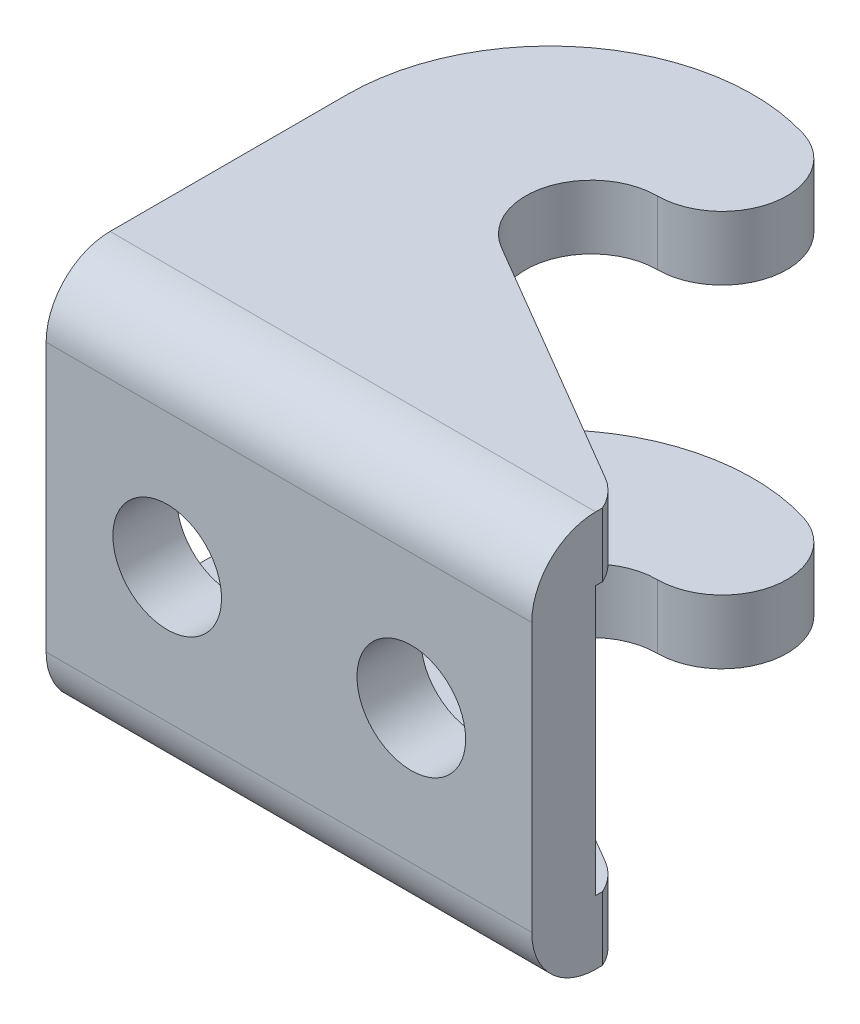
ISO-10303-21;
HEADER;
FILE_DESCRIPTION(('STEP AP214'),'2;1');
FILE_NAME('part.step','',(''),(''),'','','');
FILE_SCHEMA(('AUTOMOTIVE_DESIGN { 1 0 10303 214 1 1 1 1 }'));
ENDSEC;
DATA;
#1=APPLICATION_CONTEXT('core data for automotive mechanical design processes');
#2=APPLICATION_PROTOCOL_DEFINITION('international standard','automotive_design',2000,#1);
#3=PRODUCT_CONTEXT('',#1,'mechanical');
#4=PRODUCT('Part','Part','',(#3));
#5=PRODUCT_RELATED_PRODUCT_CATEGORY('part','',(#4));
#6=PRODUCT_DEFINITION_FORMATION('','',#4);
#7=PRODUCT_DEFINITION_CONTEXT('part definition',#1,'design');
#8=PRODUCT_DEFINITION('design','',#6,#7);
#9=PRODUCT_DEFINITION_SHAPE('','',#8);
#10=(LENGTH_UNIT() NAMED_UNIT(*) SI_UNIT(.MILLI.,.METRE.));
#11=(NAMED_UNIT(*) PLANE_ANGLE_UNIT() SI_UNIT($,.RADIAN.));
#12=(NAMED_UNIT(*) SI_UNIT($,.STERADIAN.) SOLID_ANGLE_UNIT());
#13=UNCERTAINTY_MEASURE_WITH_UNIT(LENGTH_MEASURE(1.E-05),#10,'distance_accuracy_value','');
#14=(GEOMETRIC_REPRESENTATION_CONTEXT(3) GLOBAL_UNCERTAINTY_ASSIGNED_CONTEXT((#13)) GLOBAL_UNIT_ASSIGNED_CONTEXT((#10,
#11,#12)) REPRESENTATION_CONTEXT('',''));
#15=CARTESIAN_POINT('',(0.,0.,0.));
#16=DIRECTION('',(0.,0.,1.));
#17=DIRECTION('',(1.,0.,0.));
#18=AXIS2_PLACEMENT_3D('',#15,#16,#17);
#19=CARTESIAN_POINT('',(10.0563664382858,-39.6717802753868,-5.0616060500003));
#20=DIRECTION('',(1.,0.,0.));
#21=DIRECTION('',(0.,0.,-1.));
#22=AXIS2_PLACEMENT_3D('',#19,#20,#21);
#23=CYLINDRICAL_SURFACE('',#22,0.001000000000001);
#24=CARTESIAN_POINT('',(29.5847143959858,-39.6717802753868,-5.0616060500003));
#25=DIRECTION('',(1.,0.,0.));
#26=DIRECTION('',(0.,0.,-1.));
#27=AXIS2_PLACEMENT_3D('',#24,#25,#26);
#28=CIRCLE('',#27,0.001000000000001);
#29=CARTESIAN_POINT('',(29.5847143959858,-39.6717802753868,-5.0606060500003));
#30=VERTEX_POINT('',#29);
#31=CARTESIAN_POINT('',(29.5847143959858,-39.6727802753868,-5.0616060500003));
#32=VERTEX_POINT('',#31);
#33=EDGE_CURVE('E161',#30,#32,#28,.T.);
#34=ORIENTED_EDGE('',*,*,#33,.F.);
#35=DIRECTION('',(1.,0.,0.));
#36=VECTOR('',#35,1.);
#37=CARTESIAN_POINT('',(45.4597143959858,-39.6717802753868,-5.0606060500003));
#38=LINE('',#37,#36);
#39=CARTESIAN_POINT('',(67.5847143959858,-39.6717802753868,-5.0606060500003));
#40=VERTEX_POINT('',#39);
#41=EDGE_CURVE('E163',#30,#40,#38,.T.);
#42=ORIENTED_EDGE('',*,*,#41,.T.);
#43=CARTESIAN_POINT('',(67.5847143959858,-39.6717802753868,-5.06160605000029));
#44=DIRECTION('',(-1.,0.,0.));
#45=DIRECTION('',(0.,0.,1.));
#46=AXIS2_PLACEMENT_3D('',#43,#44,#45);
#47=CIRCLE('',#46,0.001000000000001);
#48=CARTESIAN_POINT('',(67.5847143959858,-39.6727802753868,-5.06160605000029));
#49=VERTEX_POINT('',#48);
#50=EDGE_CURVE('E17',#49,#40,#47,.T.);
#51=ORIENTED_EDGE('',*,*,#50,.F.);
#52=DIRECTION('',(1.,0.,0.));
#53=VECTOR('',#52,1.);
#54=CARTESIAN_POINT('',(45.4597143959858,-39.6727802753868,-5.06160605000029));
#55=LINE('',#54,#53);
#56=EDGE_CURVE('E220',#49,#32,#55,.F.);
#57=ORIENTED_EDGE('',*,*,#56,.T.);
#58=EDGE_LOOP('',(#34,#42,#51,#57));
#59=FACE_BOUND('',#58,.T.);
#60=ADVANCED_FACE('F14',(#59),#23,.F.);
#61=CARTESIAN_POINT('',(48.5847143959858,-44.6727802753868,-23.7316365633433));
#62=DIRECTION('',(0.,1.,0.));
#63=DIRECTION('',(0.,0.,1.));
#64=AXIS2_PLACEMENT_3D('',#61,#62,#63);
#65=CYLINDRICAL_SURFACE('',#64,5.15);
#66=DIRECTION('',(0.,1.,0.));
#67=VECTOR('',#66,1.);
#68=CARTESIAN_POINT('',(48.5847143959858,-44.6727802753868,-28.8816365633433));
#69=LINE('',#68,#67);
#70=CARTESIAN_POINT('',(48.5847143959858,-39.6727802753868,-28.8816365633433));
#71=VERTEX_POINT('',#70);
#72=CARTESIAN_POINT('',(48.5847143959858,-44.6727802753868,-28.8816365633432));
#73=VERTEX_POINT('',#72);
#74=EDGE_CURVE('E232',#71,#73,#69,.F.);
#75=ORIENTED_EDGE('',*,*,#74,.F.);
#76=CARTESIAN_POINT('',(48.5847143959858,-39.6727802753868,-23.7316365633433));
#77=DIRECTION('',(0.,1.,0.));
#78=DIRECTION('',(0.,0.,1.));
#79=AXIS2_PLACEMENT_3D('',#76,#77,#78);
#80=CIRCLE('',#79,5.15);
#81=CARTESIAN_POINT('',(45.9778023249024,-39.6727802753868,-19.2901830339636));
#82=VERTEX_POINT('',#81);
#83=EDGE_CURVE('E219',#71,#82,#80,.T.);
#84=ORIENTED_EDGE('',*,*,#83,.T.);
#85=DIRECTION('',(0.,1.,0.));
#86=VECTOR('',#85,1.);
#87=CARTESIAN_POINT('',(45.9778023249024,-44.6727802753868,-19.2901830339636));
#88=LINE('',#87,#86);
#89=CARTESIAN_POINT('',(45.9778023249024,-44.6727802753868,-19.2901830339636));
#90=VERTEX_POINT('',#89);
#91=EDGE_CURVE('E233',#82,#90,#88,.F.);
#92=ORIENTED_EDGE('',*,*,#91,.T.);
#93=CARTESIAN_POINT('',(48.5847143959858,-44.6727802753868,-23.7316365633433));
#94=DIRECTION('',(0.,1.,0.));
#95=DIRECTION('',(0.,0.,1.));
#96=AXIS2_PLACEMENT_3D('',#93,#94,#95);
#97=CIRCLE('',#96,5.15);
#98=EDGE_CURVE('E199',#73,#90,#97,.T.);
#99=ORIENTED_EDGE('',*,*,#98,.F.);
#100=EDGE_LOOP('',(#75,#84,#92,#99));
#101=FACE_BOUND('',#100,.T.);
#102=ADVANCED_FACE('F381',(#101),#65,.F.);
#103=CARTESIAN_POINT('',(65.663136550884,-44.6727802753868,-7.73587202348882));
#104=DIRECTION('',(-0.506196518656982,0.,0.862418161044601));
#105=DIRECTION('',(0.862418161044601,0.,0.506196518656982));
#106=AXIS2_PLACEMENT_3D('',#103,#104,#105);
#107=PLANE('',#106);
#108=ORIENTED_EDGE('',*,*,#91,.F.);
#109=DIRECTION('',(0.862418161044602,0.,0.506196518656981));
#110=VECTOR('',#109,1.);
#111=CARTESIAN_POINT('',(45.9778023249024,-39.6727802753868,-19.2901830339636));
#112=LINE('',#111,#110);
#113=CARTESIAN_POINT('',(65.663136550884,-39.6727802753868,-7.73587202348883));
#114=VERTEX_POINT('',#113);
#115=EDGE_CURVE('E216',#82,#114,#112,.T.);
#116=ORIENTED_EDGE('',*,*,#115,.T.);
#117=DIRECTION('',(0.,1.,0.));
#118=VECTOR('',#117,1.);
#119=CARTESIAN_POINT('',(65.663136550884,-44.6727802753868,-7.73587202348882));
#120=LINE('',#119,#118);
#121=CARTESIAN_POINT('',(65.663136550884,-44.6727802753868,-7.73587202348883));
#122=VERTEX_POINT('',#121);
#123=EDGE_CURVE('E229',#122,#114,#120,.T.);
#124=ORIENTED_EDGE('',*,*,#123,.F.);
#125=DIRECTION('',(0.862418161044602,0.,0.506196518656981));
#126=VECTOR('',#125,1.);
#127=CARTESIAN_POINT('',(45.9778023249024,-44.6727802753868,-19.2901830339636));
#128=LINE('',#127,#126);
#129=EDGE_CURVE('E195',#90,#122,#128,.T.);
#130=ORIENTED_EDGE('',*,*,#129,.F.);
#131=EDGE_LOOP('',(#108,#116,#124,#130));
#132=FACE_BOUND('',#131,.T.);
#133=ADVANCED_FACE('F378',(#132),#107,.F.);
#134=CARTESIAN_POINT('',(48.5847143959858,-44.6727802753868,-33.957335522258));
#135=DIRECTION('',(0.,1.,0.));
#136=DIRECTION('',(0.,0.,1.));
#137=AXIS2_PLACEMENT_3D('',#134,#135,#136);
#138=CYLINDRICAL_SURFACE('',#137,5.07569895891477);
#139=CARTESIAN_POINT('',(48.5847143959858,-44.6727802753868,-33.957335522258));
#140=DIRECTION('',(0.,1.,0.));
#141=DIRECTION('',(0.,0.,1.));
#142=AXIS2_PLACEMENT_3D('',#139,#140,#141);
#143=CIRCLE('',#142,5.07569895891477);
#144=CARTESIAN_POINT('',(50.0534723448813,-44.6727802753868,-38.8158816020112));
#145=VERTEX_POINT('',#144);
#146=EDGE_CURVE('E280',#145,#73,#143,.F.);
#147=ORIENTED_EDGE('',*,*,#146,.F.);
#148=DIRECTION('',(0.,1.,0.));
#149=VECTOR('',#148,1.);
#150=CARTESIAN_POINT('',(50.0534723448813,-44.6727802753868,-38.8158816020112));
#151=LINE('',#150,#149);
#152=CARTESIAN_POINT('',(50.0534723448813,-39.6727802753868,-38.8158816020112));
#153=VERTEX_POINT('',#152);
#154=EDGE_CURVE('E226',#153,#145,#151,.F.);
#155=ORIENTED_EDGE('',*,*,#154,.F.);
#156=CARTESIAN_POINT('',(48.5847143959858,-39.6727802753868,-33.957335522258));
#157=DIRECTION('',(0.,1.,0.));
#158=DIRECTION('',(0.,0.,1.));
#159=AXIS2_PLACEMENT_3D('',#156,#157,#158);
#160=CIRCLE('',#159,5.07569895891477);
#161=EDGE_CURVE('E222',#153,#71,#160,.F.);
#162=ORIENTED_EDGE('',*,*,#161,.T.);
#163=ORIENTED_EDGE('',*,*,#74,.T.);
#164=EDGE_LOOP('',(#147,#155,#162,#163));
#165=FACE_BOUND('',#164,.T.);
#166=ADVANCED_FACE('F384',(#165),#138,.T.);
#167=CARTESIAN_POINT('',(39.0597143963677,-29.1727797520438,-5.0606060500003));
#168=DIRECTION('',(0.,0.,-1.));
#169=DIRECTION('',(-1.,0.,0.));
#170=AXIS2_PLACEMENT_3D('',#167,#168,#169);
#171=CYLINDRICAL_SURFACE('',#170,4.25);
#172=CARTESIAN_POINT('',(39.0597143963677,-29.1727797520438,-5.0606060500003));
#173=DIRECTION('',(0.,0.,-1.));
#174=DIRECTION('',(-1.,0.,0.));
#175=AXIS2_PLACEMENT_3D('',#172,#173,#174);
#176=CIRCLE('',#175,4.25);
#177=CARTESIAN_POINT('',(34.8097143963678,-29.1727797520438,-5.0606060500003));
#178=VERTEX_POINT('',#177);
#179=EDGE_CURVE('E168',#178,#178,#176,.T.);
#180=ORIENTED_EDGE('',*,*,#179,.T.);
#181=EDGE_LOOP('',(#180));
#182=FACE_BOUND('',#181,.T.);
#183=CARTESIAN_POINT('',(39.0597143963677,-29.1727797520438,-0.0606060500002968));
#184=DIRECTION('',(0.,0.,-1.));
#185=DIRECTION('',(-1.,0.,0.));
#186=AXIS2_PLACEMENT_3D('',#183,#184,#185);
#187=CIRCLE('',#186,4.25);
#188=CARTESIAN_POINT('',(34.8097143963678,-29.1727797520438,-0.0606060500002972));
#189=VERTEX_POINT('',#188);
#190=EDGE_CURVE('E211',#189,#189,#187,.T.);
#191=ORIENTED_EDGE('',*,*,#190,.F.);
#192=EDGE_LOOP('',(#191));
#193=FACE_BOUND('',#192,.T.);
#194=ADVANCED_FACE('F541',(#182,#193),#171,.F.);
#195=CARTESIAN_POINT('',(58.1597143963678,-29.1727797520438,-0.0606060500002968));
#196=DIRECTION('',(0.,0.,1.));
#197=DIRECTION('',(1.,0.,0.));
#198=AXIS2_PLACEMENT_3D('',#195,#196,#197);
#199=CYLINDRICAL_SURFACE('',#198,4.25);
#200=CARTESIAN_POINT('',(58.1597143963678,-29.1727797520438,-5.0606060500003));
#201=DIRECTION('',(0.,0.,1.));
#202=DIRECTION('',(1.,0.,0.));
#203=AXIS2_PLACEMENT_3D('',#200,#201,#202);
#204=CIRCLE('',#203,4.25);
#205=CARTESIAN_POINT('',(62.4097143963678,-29.1727797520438,-5.0606060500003));
#206=VERTEX_POINT('',#205);
#207=EDGE_CURVE('E286',#206,#206,#204,.F.);
#208=ORIENTED_EDGE('',*,*,#207,.T.);
#209=EDGE_LOOP('',(#208));
#210=FACE_BOUND('',#209,.T.);
#211=CARTESIAN_POINT('',(58.1597143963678,-29.1727797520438,-0.0606060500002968));
#212=DIRECTION('',(0.,0.,1.));
#213=DIRECTION('',(1.,0.,0.));
#214=AXIS2_PLACEMENT_3D('',#211,#212,#213);
#215=CIRCLE('',#214,4.25);
#216=CARTESIAN_POINT('',(62.4097143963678,-29.1727797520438,-0.0606060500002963));
#217=VERTEX_POINT('',#216);
#218=EDGE_CURVE('E189',#217,#217,#215,.F.);
#219=ORIENTED_EDGE('',*,*,#218,.F.);
#220=EDGE_LOOP('',(#219));
#221=FACE_BOUND('',#220,.T.);
#222=ADVANCED_FACE('F532',(#210,#221),#199,.F.);
#223=CARTESIAN_POINT('',(63.252375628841,-44.6727802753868,-3.62860552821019));
#224=DIRECTION('',(0.,1.,0.));
#225=DIRECTION('',(0.,0.,1.));
#226=AXIS2_PLACEMENT_3D('',#223,#224,#225);
#227=CYLINDRICAL_SURFACE('',#226,4.76250000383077);
#228=CARTESIAN_POINT('',(63.252375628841,-44.6727802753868,-3.62860552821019));
#229=DIRECTION('',(0.,1.,0.));
#230=DIRECTION('',(0.,0.,1.));
#231=AXIS2_PLACEMENT_3D('',#228,#229,#230);
#232=CIRCLE('',#231,4.76250000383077);
#233=CARTESIAN_POINT('',(67.5847143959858,-44.6727802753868,-5.60654564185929));
#234=VERTEX_POINT('',#233);
#235=EDGE_CURVE('E198',#122,#234,#232,.F.);
#236=ORIENTED_EDGE('',*,*,#235,.F.);
#237=ORIENTED_EDGE('',*,*,#123,.T.);
#238=CARTESIAN_POINT('',(63.252375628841,-39.6727802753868,-3.62860552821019));
#239=DIRECTION('',(0.,1.,0.));
#240=DIRECTION('',(0.,0.,1.));
#241=AXIS2_PLACEMENT_3D('',#238,#239,#240);
#242=CIRCLE('',#241,4.76250000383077);
#243=CARTESIAN_POINT('',(67.5847143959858,-39.6727802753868,-5.60654564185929));
#244=VERTEX_POINT('',#243);
#245=EDGE_CURVE('E218',#114,#244,#242,.F.);
#246=ORIENTED_EDGE('',*,*,#245,.T.);
#247=DIRECTION('',(0.,1.,0.));
#248=VECTOR('',#247,1.);
#249=CARTESIAN_POINT('',(67.5847143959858,-44.6727802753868,-5.60654564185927));
#250=LINE('',#249,#248);
#251=EDGE_CURVE('E176',#244,#234,#250,.F.);
#252=ORIENTED_EDGE('',*,*,#251,.T.);
#253=EDGE_LOOP('',(#236,#237,#246,#252));
#254=FACE_BOUND('',#253,.T.);
#255=ADVANCED_FACE('F373',(#254),#227,.T.);
#256=CARTESIAN_POINT('',(87.1130623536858,-18.6737792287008,-5.06160605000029));
#257=DIRECTION('',(-1.,0.,0.));
#258=DIRECTION('',(0.,0.,1.));
#259=AXIS2_PLACEMENT_3D('',#256,#257,#258);
#260=CYLINDRICAL_SURFACE('',#259,0.000999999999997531);
#261=CARTESIAN_POINT('',(29.5847143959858,-18.6737792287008,-5.0616060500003));
#262=DIRECTION('',(1.,0.,0.));
#263=DIRECTION('',(0.,0.,-1.));
#264=AXIS2_PLACEMENT_3D('',#261,#262,#263);
#265=CIRCLE('',#264,0.000999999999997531);
#266=CARTESIAN_POINT('',(29.5847143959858,-18.6727792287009,-5.0616060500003));
#267=VERTEX_POINT('',#266);
#268=CARTESIAN_POINT('',(29.5847143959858,-18.6737792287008,-5.0606060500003));
#269=VERTEX_POINT('',#268);
#270=EDGE_CURVE('E223',#267,#269,#265,.T.);
#271=ORIENTED_EDGE('',*,*,#270,.F.);
#272=DIRECTION('',(-1.,0.,0.));
#273=VECTOR('',#272,1.);
#274=CARTESIAN_POINT('',(45.4597143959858,-18.6727792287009,-5.0616060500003));
#275=LINE('',#274,#273);
#276=CARTESIAN_POINT('',(67.5847143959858,-18.6727792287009,-5.0616060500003));
#277=VERTEX_POINT('',#276);
#278=EDGE_CURVE('E213',#267,#277,#275,.F.);
#279=ORIENTED_EDGE('',*,*,#278,.T.);
#280=CARTESIAN_POINT('',(67.5847143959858,-18.6737792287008,-5.06160605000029));
#281=DIRECTION('',(-1.,0.,0.));
#282=DIRECTION('',(0.,0.,1.));
#283=AXIS2_PLACEMENT_3D('',#280,#281,#282);
#284=CIRCLE('',#283,0.000999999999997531);
#285=CARTESIAN_POINT('',(67.5847143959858,-18.6737792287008,-5.0606060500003));
#286=VERTEX_POINT('',#285);
#287=EDGE_CURVE('E174',#277,#286,#284,.F.);
#288=ORIENTED_EDGE('',*,*,#287,.T.);
#289=DIRECTION('',(1.,0.,0.));
#290=VECTOR('',#289,1.);
#291=CARTESIAN_POINT('',(45.4597143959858,-18.6737792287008,-5.0606060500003));
#292=LINE('',#291,#290);
#293=EDGE_CURVE('E167',#286,#269,#292,.F.);
#294=ORIENTED_EDGE('',*,*,#293,.T.);
#295=EDGE_LOOP('',(#271,#279,#288,#294));
#296=FACE_BOUND('',#295,.T.);
#297=ADVANCED_FACE('F514',(#296),#260,.F.);
#298=CARTESIAN_POINT('',(45.4597143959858,-39.6727802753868,42.3519715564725));
#299=DIRECTION('',(0.,-1.,0.));
#300=DIRECTION('',(0.,0.,-1.));
#301=AXIS2_PLACEMENT_3D('',#298,#299,#300);
#302=PLANE('',#301);
#303=ORIENTED_EDGE('',*,*,#115,.F.);
#304=ORIENTED_EDGE('',*,*,#83,.F.);
#305=ORIENTED_EDGE('',*,*,#161,.F.);
#306=CARTESIAN_POINT('',(45.4597143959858,-39.6727802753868,-23.6200593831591));
#307=DIRECTION('',(0.,1.,0.));
#308=DIRECTION('',(0.,0.,1.));
#309=AXIS2_PLACEMENT_3D('',#306,#307,#308);
#310=CIRCLE('',#309,15.875);
#311=CARTESIAN_POINT('',(29.5847143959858,-39.6727802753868,-23.6200593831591));
#312=VERTEX_POINT('',#311);
#313=EDGE_CURVE('E203',#312,#153,#310,.F.);
#314=ORIENTED_EDGE('',*,*,#313,.F.);
#315=DIRECTION('',(0.,0.,-1.));
#316=VECTOR('',#315,1.);
#317=CARTESIAN_POINT('',(29.5847143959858,-39.6727802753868,42.3519715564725));
#318=LINE('',#317,#316);
#319=EDGE_CURVE('E299',#312,#32,#318,.F.);
#320=ORIENTED_EDGE('',*,*,#319,.T.);
#321=ORIENTED_EDGE('',*,*,#56,.F.);
#322=DIRECTION('',(0.,0.,1.));
#323=VECTOR('',#322,1.);
#324=CARTESIAN_POINT('',(67.5847143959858,-39.6727802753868,-5.60654564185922));
#325=LINE('',#324,#323);
#326=EDGE_CURVE('E160',#49,#244,#325,.F.);
#327=ORIENTED_EDGE('',*,*,#326,.T.);
#328=ORIENTED_EDGE('',*,*,#245,.F.);
#329=EDGE_LOOP('',(#303,#304,#305,#314,#320,#321,#327,#328));
#330=FACE_BOUND('',#329,.T.);
#331=ADVANCED_FACE('F303',(#330),#302,.F.);
#332=CARTESIAN_POINT('',(45.4597143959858,3.81323571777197,-5.0606060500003));
#333=DIRECTION('',(0.,0.,1.));
#334=DIRECTION('',(1.,0.,0.));
#335=AXIS2_PLACEMENT_3D('',#332,#333,#334);
#336=PLANE('',#335);
#337=ORIENTED_EDGE('',*,*,#293,.F.);
#338=DIRECTION('',(0.,1.,0.));
#339=VECTOR('',#338,1.);
#340=CARTESIAN_POINT('',(67.5847143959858,-44.6727802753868,-5.0606060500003));
#341=LINE('',#340,#339);
#342=EDGE_CURVE('E157',#286,#40,#341,.F.);
#343=ORIENTED_EDGE('',*,*,#342,.T.);
#344=ORIENTED_EDGE('',*,*,#41,.F.);
#345=DIRECTION('',(0.,1.,0.));
#346=VECTOR('',#345,1.);
#347=CARTESIAN_POINT('',(29.5847143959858,-44.6727802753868,-5.0606060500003));
#348=LINE('',#347,#346);
#349=EDGE_CURVE('E300',#30,#269,#348,.T.);
#350=ORIENTED_EDGE('',*,*,#349,.T.);
#351=EDGE_LOOP('',(#337,#343,#344,#350));
#352=FACE_BOUND('',#351,.T.);
#353=ORIENTED_EDGE('',*,*,#179,.F.);
#354=EDGE_LOOP('',(#353));
#355=FACE_BOUND('',#354,.T.);
#356=ORIENTED_EDGE('',*,*,#207,.F.);
#357=EDGE_LOOP('',(#356));
#358=FACE_BOUND('',#357,.T.);
#359=ADVANCED_FACE('F171',(#352,#355,#358),#336,.F.);
#360=CARTESIAN_POINT('',(10.0563664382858,-39.6717802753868,-5.0616060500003));
#361=DIRECTION('',(1.,0.,0.));
#362=DIRECTION('',(0.,0.,-1.));
#363=AXIS2_PLACEMENT_3D('',#360,#361,#362);
#364=CYLINDRICAL_SURFACE('',#363,5.001);
#365=DIRECTION('',(1.,0.,0.));
#366=VECTOR('',#365,1.);
#367=CARTESIAN_POINT('',(45.4597143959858,-44.6727802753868,-5.06160605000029));
#368=LINE('',#367,#366);
#369=CARTESIAN_POINT('',(67.5847143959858,-44.6727802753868,-5.06160605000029));
#370=VERTEX_POINT('',#369);
#371=CARTESIAN_POINT('',(29.5847143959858,-44.6727802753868,-5.0616060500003));
#372=VERTEX_POINT('',#371);
#373=EDGE_CURVE('E200',#370,#372,#368,.F.);
#374=ORIENTED_EDGE('',*,*,#373,.F.);
#375=CARTESIAN_POINT('',(67.5847143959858,-39.6717802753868,-5.06160605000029));
#376=DIRECTION('',(1.,0.,0.));
#377=DIRECTION('',(0.,0.,-1.));
#378=AXIS2_PLACEMENT_3D('',#375,#376,#377);
#379=CIRCLE('',#378,5.001);
#380=CARTESIAN_POINT('',(67.5847143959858,-39.6717802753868,-0.0606060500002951));
#381=VERTEX_POINT('',#380);
#382=EDGE_CURVE('E185',#370,#381,#379,.F.);
#383=ORIENTED_EDGE('',*,*,#382,.T.);
#384=DIRECTION('',(1.,0.,0.));
#385=VECTOR('',#384,1.);
#386=CARTESIAN_POINT('',(45.4597143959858,-39.6717802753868,-0.0606060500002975));
#387=LINE('',#386,#385);
#388=CARTESIAN_POINT('',(29.5847143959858,-39.6717802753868,-0.0606060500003));
#389=VERTEX_POINT('',#388);
#390=EDGE_CURVE('E208',#389,#381,#387,.T.);
#391=ORIENTED_EDGE('',*,*,#390,.F.);
#392=CARTESIAN_POINT('',(29.5847143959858,-39.6717802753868,-5.0616060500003));
#393=DIRECTION('',(1.,0.,0.));
#394=DIRECTION('',(0.,0.,-1.));
#395=AXIS2_PLACEMENT_3D('',#392,#393,#394);
#396=CIRCLE('',#395,5.001);
#397=EDGE_CURVE('E255',#389,#372,#396,.T.);
#398=ORIENTED_EDGE('',*,*,#397,.T.);
#399=EDGE_LOOP('',(#374,#383,#391,#398));
#400=FACE_BOUND('',#399,.T.);
#401=ADVANCED_FACE('F367',(#400),#364,.T.);
#402=CARTESIAN_POINT('',(45.4597143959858,-44.6727802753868,42.3519715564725));
#403=DIRECTION('',(0.,-1.,0.));
#404=DIRECTION('',(0.,0.,-1.));
#405=AXIS2_PLACEMENT_3D('',#402,#403,#404);
#406=PLANE('',#405);
#407=DIRECTION('',(0.,0.,-1.));
#408=VECTOR('',#407,1.);
#409=CARTESIAN_POINT('',(29.5847143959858,-44.6727802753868,42.3519715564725));
#410=LINE('',#409,#408);
#411=CARTESIAN_POINT('',(29.5847143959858,-44.6727802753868,-23.6200593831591));
#412=VERTEX_POINT('',#411);
#413=EDGE_CURVE('E207',#372,#412,#410,.T.);
#414=ORIENTED_EDGE('',*,*,#413,.T.);
#415=CARTESIAN_POINT('',(45.4597143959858,-44.6727802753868,-23.6200593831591));
#416=DIRECTION('',(0.,1.,0.));
#417=DIRECTION('',(0.,0.,1.));
#418=AXIS2_PLACEMENT_3D('',#415,#416,#417);
#419=CIRCLE('',#418,15.875);
#420=EDGE_CURVE('E212',#145,#412,#419,.T.);
#421=ORIENTED_EDGE('',*,*,#420,.F.);
#422=ORIENTED_EDGE('',*,*,#146,.T.);
#423=ORIENTED_EDGE('',*,*,#98,.T.);
#424=ORIENTED_EDGE('',*,*,#129,.T.);
#425=ORIENTED_EDGE('',*,*,#235,.T.);
#426=DIRECTION('',(0.,0.,1.));
#427=VECTOR('',#426,1.);
#428=CARTESIAN_POINT('',(67.5847143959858,-44.6727802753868,-5.60654564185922));
#429=LINE('',#428,#427);
#430=EDGE_CURVE('E186',#234,#370,#429,.T.);
#431=ORIENTED_EDGE('',*,*,#430,.T.);
#432=ORIENTED_EDGE('',*,*,#373,.T.);
#433=EDGE_LOOP('',(#414,#421,#422,#423,#424,#425,#431,#432));
#434=FACE_BOUND('',#433,.T.);
#435=ADVANCED_FACE('F369',(#434),#406,.T.);
#436=CARTESIAN_POINT('',(45.4597143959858,-44.6727802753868,-23.6200593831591));
#437=DIRECTION('',(0.,1.,0.));
#438=DIRECTION('',(0.,0.,1.));
#439=AXIS2_PLACEMENT_3D('',#436,#437,#438);
#440=CYLINDRICAL_SURFACE('',#439,15.875);
#441=ORIENTED_EDGE('',*,*,#420,.T.);
#442=DIRECTION('',(0.,1.,0.));
#443=VECTOR('',#442,1.);
#444=CARTESIAN_POINT('',(29.5847143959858,-44.6727802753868,-23.6200593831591));
#445=LINE('',#444,#443);
#446=EDGE_CURVE('E204',#412,#312,#445,.T.);
#447=ORIENTED_EDGE('',*,*,#446,.T.);
#448=ORIENTED_EDGE('',*,*,#313,.T.);
#449=ORIENTED_EDGE('',*,*,#154,.T.);
#450=EDGE_LOOP('',(#441,#447,#448,#449));
#451=FACE_BOUND('',#450,.T.);
#452=ADVANCED_FACE('F387',(#451),#440,.T.);
#453=CARTESIAN_POINT('',(45.4597143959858,3.81323571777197,-0.0606060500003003));
#454=DIRECTION('',(0.,0.,1.));
#455=DIRECTION('',(1.,0.,0.));
#456=AXIS2_PLACEMENT_3D('',#453,#454,#455);
#457=PLANE('',#456);
#458=ORIENTED_EDGE('',*,*,#218,.T.);
#459=EDGE_LOOP('',(#458));
#460=FACE_BOUND('',#459,.T.);
#461=ORIENTED_EDGE('',*,*,#190,.T.);
#462=EDGE_LOOP('',(#461));
#463=FACE_BOUND('',#462,.T.);
#464=DIRECTION('',(-1.,0.,0.));
#465=VECTOR('',#464,1.);
#466=CARTESIAN_POINT('',(87.1130623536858,-18.6737792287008,-0.0606060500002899));
#467=LINE('',#466,#465);
#468=CARTESIAN_POINT('',(29.5847143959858,-18.6737792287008,-0.0606060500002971));
#469=VERTEX_POINT('',#468);
#470=CARTESIAN_POINT('',(67.5847143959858,-18.6737792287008,-0.0606060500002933));
#471=VERTEX_POINT('',#470);
#472=EDGE_CURVE('E190',#469,#471,#467,.F.);
#473=ORIENTED_EDGE('',*,*,#472,.F.);
#474=DIRECTION('',(0.,1.,0.));
#475=VECTOR('',#474,1.);
#476=CARTESIAN_POINT('',(29.5847143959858,-44.6727802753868,-0.0606060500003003));
#477=LINE('',#476,#475);
#478=EDGE_CURVE('E257',#469,#389,#477,.F.);
#479=ORIENTED_EDGE('',*,*,#478,.T.);
#480=ORIENTED_EDGE('',*,*,#390,.T.);
#481=DIRECTION('',(0.,1.,0.));
#482=VECTOR('',#481,1.);
#483=CARTESIAN_POINT('',(67.5847143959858,-44.6727802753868,-0.0606060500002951));
#484=LINE('',#483,#482);
#485=EDGE_CURVE('E183',#381,#471,#484,.T.);
#486=ORIENTED_EDGE('',*,*,#485,.T.);
#487=EDGE_LOOP('',(#473,#479,#480,#486));
#488=FACE_BOUND('',#487,.T.);
#489=ADVANCED_FACE('F362',(#460,#463,#488),#457,.T.);
#490=CARTESIAN_POINT('',(67.5847143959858,-44.6727802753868,-5.60654564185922));
#491=DIRECTION('',(-1.,0.,0.));
#492=DIRECTION('',(0.,0.,1.));
#493=AXIS2_PLACEMENT_3D('',#490,#491,#492);
#494=PLANE('',#493);
#495=ORIENTED_EDGE('',*,*,#326,.F.);
#496=ORIENTED_EDGE('',*,*,#50,.T.);
#497=ORIENTED_EDGE('',*,*,#342,.F.);
#498=ORIENTED_EDGE('',*,*,#287,.F.);
#499=DIRECTION('',(0.,0.,1.));
#500=VECTOR('',#499,1.);
#501=CARTESIAN_POINT('',(67.5847143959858,-18.6727792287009,-23.6200593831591));
#502=LINE('',#501,#500);
#503=CARTESIAN_POINT('',(67.5847143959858,-18.6727792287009,-5.6065456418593));
#504=VERTEX_POINT('',#503);
#505=EDGE_CURVE('E214',#277,#504,#502,.F.);
#506=ORIENTED_EDGE('',*,*,#505,.T.);
#507=DIRECTION('',(0.,-1.,0.));
#508=VECTOR('',#507,1.);
#509=CARTESIAN_POINT('',(67.5847143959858,-13.6727792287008,-5.60654564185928));
#510=LINE('',#509,#508);
#511=CARTESIAN_POINT('',(67.5847143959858,-13.6727792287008,-5.6065456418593));
#512=VERTEX_POINT('',#511);
#513=EDGE_CURVE('E250',#512,#504,#510,.T.);
#514=ORIENTED_EDGE('',*,*,#513,.F.);
#515=DIRECTION('',(0.,0.,1.));
#516=VECTOR('',#515,1.);
#517=CARTESIAN_POINT('',(67.5847143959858,-13.6727792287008,-5.60654564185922));
#518=LINE('',#517,#516);
#519=CARTESIAN_POINT('',(67.5847143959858,-13.6727792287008,-5.06160605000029));
#520=VERTEX_POINT('',#519);
#521=EDGE_CURVE('E178',#520,#512,#518,.F.);
#522=ORIENTED_EDGE('',*,*,#521,.F.);
#523=CARTESIAN_POINT('',(67.5847143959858,-18.6737792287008,-5.06160605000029));
#524=DIRECTION('',(-1.,0.,0.));
#525=DIRECTION('',(0.,0.,1.));
#526=AXIS2_PLACEMENT_3D('',#523,#524,#525);
#527=CIRCLE('',#526,5.001);
#528=EDGE_CURVE('E193',#471,#520,#527,.T.);
#529=ORIENTED_EDGE('',*,*,#528,.F.);
#530=ORIENTED_EDGE('',*,*,#485,.F.);
#531=ORIENTED_EDGE('',*,*,#382,.F.);
#532=ORIENTED_EDGE('',*,*,#430,.F.);
#533=ORIENTED_EDGE('',*,*,#251,.F.);
#534=EDGE_LOOP('',(#495,#496,#497,#498,#506,#514,#522,#529,#530,#531,#532,#533));
#535=FACE_BOUND('',#534,.T.);
#536=ADVANCED_FACE('F154',(#535),#494,.F.);
#537=CARTESIAN_POINT('',(45.4597143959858,-18.6727792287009,-23.6200593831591));
#538=DIRECTION('',(0.,1.,0.));
#539=DIRECTION('',(-1.,0.,0.));
#540=AXIS2_PLACEMENT_3D('',#537,#538,#539);
#541=PLANE('',#540);
#542=CARTESIAN_POINT('',(45.4597143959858,-18.6727792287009,-23.6200593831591));
#543=DIRECTION('',(0.,-1.,0.));
#544=DIRECTION('',(1.,0.,0.));
#545=AXIS2_PLACEMENT_3D('',#542,#543,#544);
#546=CIRCLE('',#545,15.875);
#547=CARTESIAN_POINT('',(50.0534723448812,-18.6727792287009,-38.8158816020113));
#548=VERTEX_POINT('',#547);
#549=CARTESIAN_POINT('',(29.5847143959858,-18.6727792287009,-23.6200593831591));
#550=VERTEX_POINT('',#549);
#551=EDGE_CURVE('E258',#548,#550,#546,.F.);
#552=ORIENTED_EDGE('',*,*,#551,.F.);
#553=CARTESIAN_POINT('',(48.5847143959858,-18.6727792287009,-33.957335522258));
#554=DIRECTION('',(0.,-1.,0.));
#555=DIRECTION('',(1.,0.,0.));
#556=AXIS2_PLACEMENT_3D('',#553,#554,#555);
#557=CIRCLE('',#556,5.07569895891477);
#558=CARTESIAN_POINT('',(48.5847143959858,-18.6727792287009,-28.8816365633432));
#559=VERTEX_POINT('',#558);
#560=EDGE_CURVE('E262',#559,#548,#557,.F.);
#561=ORIENTED_EDGE('',*,*,#560,.F.);
#562=CARTESIAN_POINT('',(48.5847143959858,-18.6727792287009,-23.7316365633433));
#563=DIRECTION('',(0.,-1.,0.));
#564=DIRECTION('',(1.,0.,0.));
#565=AXIS2_PLACEMENT_3D('',#562,#563,#564);
#566=CIRCLE('',#565,5.15);
#567=CARTESIAN_POINT('',(45.9778023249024,-18.6727792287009,-19.2901830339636));
#568=VERTEX_POINT('',#567);
#569=EDGE_CURVE('E266',#559,#568,#566,.F.);
#570=ORIENTED_EDGE('',*,*,#569,.T.);
#571=DIRECTION('',(0.862418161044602,0.,0.506196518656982));
#572=VECTOR('',#571,1.);
#573=CARTESIAN_POINT('',(65.663136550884,-18.6727792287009,-7.73587202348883));
#574=LINE('',#573,#572);
#575=CARTESIAN_POINT('',(65.663136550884,-18.6727792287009,-7.73587202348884));
#576=VERTEX_POINT('',#575);
#577=EDGE_CURVE('E317',#568,#576,#574,.T.);
#578=ORIENTED_EDGE('',*,*,#577,.T.);
#579=CARTESIAN_POINT('',(63.252375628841,-18.6727792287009,-3.6286055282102));
#580=DIRECTION('',(0.,-1.,0.));
#581=DIRECTION('',(1.,0.,0.));
#582=AXIS2_PLACEMENT_3D('',#579,#580,#581);
#583=CIRCLE('',#582,4.76250000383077);
#584=EDGE_CURVE('E248',#504,#576,#583,.F.);
#585=ORIENTED_EDGE('',*,*,#584,.F.);
#586=ORIENTED_EDGE('',*,*,#505,.F.);
#587=ORIENTED_EDGE('',*,*,#278,.F.);
#588=DIRECTION('',(0.,0.,-1.));
#589=VECTOR('',#588,1.);
#590=CARTESIAN_POINT('',(29.5847143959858,-18.6727792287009,42.3519715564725));
#591=LINE('',#590,#589);
#592=EDGE_CURVE('E305',#267,#550,#591,.T.);
#593=ORIENTED_EDGE('',*,*,#592,.T.);
#594=EDGE_LOOP('',(#552,#561,#570,#578,#585,#586,#587,#593));
#595=FACE_BOUND('',#594,.T.);
#596=ADVANCED_FACE('F325',(#595),#541,.F.);
#597=CARTESIAN_POINT('',(48.5847143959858,-13.6727792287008,-23.7316365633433));
#598=DIRECTION('',(0.,-1.,0.));
#599=DIRECTION('',(1.,0.,0.));
#600=AXIS2_PLACEMENT_3D('',#597,#598,#599);
#601=CYLINDRICAL_SURFACE('',#600,5.15);
#602=DIRECTION('',(0.,1.,0.));
#603=VECTOR('',#602,1.);
#604=CARTESIAN_POINT('',(45.9778023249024,-13.6727792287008,-19.2901830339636));
#605=LINE('',#604,#603);
#606=CARTESIAN_POINT('',(45.9778023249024,-13.6727792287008,-19.2901830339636));
#607=VERTEX_POINT('',#606);
#608=EDGE_CURVE('E318',#607,#568,#605,.F.);
#609=ORIENTED_EDGE('',*,*,#608,.T.);
#610=ORIENTED_EDGE('',*,*,#569,.F.);
#611=DIRECTION('',(0.,-1.,0.));
#612=VECTOR('',#611,1.);
#613=CARTESIAN_POINT('',(48.5847143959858,-13.6727792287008,-28.8816365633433));
#614=LINE('',#613,#612);
#615=CARTESIAN_POINT('',(48.5847143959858,-13.6727792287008,-28.8816365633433));
#616=VERTEX_POINT('',#615);
#617=EDGE_CURVE('E265',#616,#559,#614,.T.);
#618=ORIENTED_EDGE('',*,*,#617,.F.);
#619=CARTESIAN_POINT('',(48.5847143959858,-13.6727792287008,-23.7316365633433));
#620=DIRECTION('',(0.,-1.,0.));
#621=DIRECTION('',(1.,0.,0.));
#622=AXIS2_PLACEMENT_3D('',#619,#620,#621);
#623=CIRCLE('',#622,5.15);
#624=EDGE_CURVE('E245',#607,#616,#623,.T.);
#625=ORIENTED_EDGE('',*,*,#624,.F.);
#626=EDGE_LOOP('',(#609,#610,#618,#625));
#627=FACE_BOUND('',#626,.T.);
#628=ADVANCED_FACE('F352',(#627),#601,.F.);
#629=CARTESIAN_POINT('',(48.5847143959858,-13.6727792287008,-33.957335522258));
#630=DIRECTION('',(0.,-1.,0.));
#631=DIRECTION('',(1.,0.,0.));
#632=AXIS2_PLACEMENT_3D('',#629,#630,#631);
#633=CYLINDRICAL_SURFACE('',#632,5.07569895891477);
#634=ORIENTED_EDGE('',*,*,#560,.T.);
#635=DIRECTION('',(0.,-1.,0.));
#636=VECTOR('',#635,1.);
#637=CARTESIAN_POINT('',(50.0534723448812,-13.6727792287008,-38.8158816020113));
#638=LINE('',#637,#636);
#639=CARTESIAN_POINT('',(50.0534723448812,-13.6727792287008,-38.8158816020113));
#640=VERTEX_POINT('',#639);
#641=EDGE_CURVE('E261',#640,#548,#638,.T.);
#642=ORIENTED_EDGE('',*,*,#641,.F.);
#643=CARTESIAN_POINT('',(48.5847143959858,-13.6727792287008,-33.957335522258));
#644=DIRECTION('',(0.,-1.,0.));
#645=DIRECTION('',(1.,0.,0.));
#646=AXIS2_PLACEMENT_3D('',#643,#644,#645);
#647=CIRCLE('',#646,5.07569895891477);
#648=EDGE_CURVE('E243',#616,#640,#647,.F.);
#649=ORIENTED_EDGE('',*,*,#648,.F.);
#650=ORIENTED_EDGE('',*,*,#617,.T.);
#651=EDGE_LOOP('',(#634,#642,#649,#650));
#652=FACE_BOUND('',#651,.T.);
#653=ADVANCED_FACE('F349',(#652),#633,.T.);
#654=CARTESIAN_POINT('',(45.4597143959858,-13.6727792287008,-23.6200593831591));
#655=DIRECTION('',(0.,-1.,0.));
#656=DIRECTION('',(1.,0.,0.));
#657=AXIS2_PLACEMENT_3D('',#654,#655,#656);
#658=CYLINDRICAL_SURFACE('',#657,15.875);
#659=CARTESIAN_POINT('',(45.4597143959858,-13.6727792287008,-23.6200593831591));
#660=DIRECTION('',(0.,-1.,0.));
#661=DIRECTION('',(1.,0.,0.));
#662=AXIS2_PLACEMENT_3D('',#659,#660,#661);
#663=CIRCLE('',#662,15.875);
#664=CARTESIAN_POINT('',(29.5847143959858,-13.6727792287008,-23.6200593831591));
#665=VERTEX_POINT('',#664);
#666=EDGE_CURVE('E239',#640,#665,#663,.F.);
#667=ORIENTED_EDGE('',*,*,#666,.F.);
#668=ORIENTED_EDGE('',*,*,#641,.T.);
#669=ORIENTED_EDGE('',*,*,#551,.T.);
#670=DIRECTION('',(0.,1.,0.));
#671=VECTOR('',#670,1.);
#672=CARTESIAN_POINT('',(29.5847143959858,-44.6727802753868,-23.6200593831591));
#673=LINE('',#672,#671);
#674=EDGE_CURVE('E311',#550,#665,#673,.T.);
#675=ORIENTED_EDGE('',*,*,#674,.T.);
#676=EDGE_LOOP('',(#667,#668,#669,#675));
#677=FACE_BOUND('',#676,.T.);
#678=ADVANCED_FACE('F339',(#677),#658,.T.);
#679=CARTESIAN_POINT('',(29.5847143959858,-44.6727802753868,42.3519715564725));
#680=DIRECTION('',(1.,0.,0.));
#681=DIRECTION('',(0.,0.,-1.));
#682=AXIS2_PLACEMENT_3D('',#679,#680,#681);
#683=PLANE('',#682);
#684=ORIENTED_EDGE('',*,*,#413,.F.);
#685=ORIENTED_EDGE('',*,*,#397,.F.);
#686=ORIENTED_EDGE('',*,*,#478,.F.);
#687=CARTESIAN_POINT('',(29.5847143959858,-18.6737792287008,-5.0616060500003));
#688=DIRECTION('',(-1.,0.,0.));
#689=DIRECTION('',(0.,0.,1.));
#690=AXIS2_PLACEMENT_3D('',#687,#688,#689);
#691=CIRCLE('',#690,5.001);
#692=CARTESIAN_POINT('',(29.5847143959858,-13.6727792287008,-5.06160605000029));
#693=VERTEX_POINT('',#692);
#694=EDGE_CURVE('E194',#693,#469,#691,.F.);
#695=ORIENTED_EDGE('',*,*,#694,.F.);
#696=DIRECTION('',(0.,0.,1.));
#697=VECTOR('',#696,1.);
#698=CARTESIAN_POINT('',(29.5847143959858,-13.6727792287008,-23.6200593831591));
#699=LINE('',#698,#697);
#700=EDGE_CURVE('E242',#665,#693,#699,.T.);
#701=ORIENTED_EDGE('',*,*,#700,.F.);
#702=ORIENTED_EDGE('',*,*,#674,.F.);
#703=ORIENTED_EDGE('',*,*,#592,.F.);
#704=ORIENTED_EDGE('',*,*,#270,.T.);
#705=ORIENTED_EDGE('',*,*,#349,.F.);
#706=ORIENTED_EDGE('',*,*,#33,.T.);
#707=ORIENTED_EDGE('',*,*,#319,.F.);
#708=ORIENTED_EDGE('',*,*,#446,.F.);
#709=EDGE_LOOP('',(#684,#685,#686,#695,#701,#702,#703,#704,#705,#706,#707,#708));
#710=FACE_BOUND('',#709,.T.);
#711=ADVANCED_FACE('F296',(#710),#683,.F.);
#712=CARTESIAN_POINT('',(87.1130623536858,-18.6737792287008,-5.06160605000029));
#713=DIRECTION('',(-1.,0.,0.));
#714=DIRECTION('',(0.,0.,1.));
#715=AXIS2_PLACEMENT_3D('',#712,#713,#714);
#716=CYLINDRICAL_SURFACE('',#715,5.001);
#717=ORIENTED_EDGE('',*,*,#472,.T.);
#718=ORIENTED_EDGE('',*,*,#528,.T.);
#719=DIRECTION('',(-1.,0.,0.));
#720=VECTOR('',#719,1.);
#721=CARTESIAN_POINT('',(45.4597143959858,-13.6727792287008,-5.06160605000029));
#722=LINE('',#721,#720);
#723=EDGE_CURVE('E238',#693,#520,#722,.F.);
#724=ORIENTED_EDGE('',*,*,#723,.F.);
#725=ORIENTED_EDGE('',*,*,#694,.T.);
#726=EDGE_LOOP('',(#717,#718,#724,#725));
#727=FACE_BOUND('',#726,.T.);
#728=ADVANCED_FACE('F359',(#727),#716,.T.);
#729=CARTESIAN_POINT('',(63.252375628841,-13.6727792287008,-3.6286055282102));
#730=DIRECTION('',(0.,-1.,0.));
#731=DIRECTION('',(1.,0.,0.));
#732=AXIS2_PLACEMENT_3D('',#729,#730,#731);
#733=CYLINDRICAL_SURFACE('',#732,4.76250000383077);
#734=CARTESIAN_POINT('',(63.252375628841,-13.6727792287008,-3.6286055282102));
#735=DIRECTION('',(0.,-1.,0.));
#736=DIRECTION('',(1.,0.,0.));
#737=AXIS2_PLACEMENT_3D('',#734,#735,#736);
#738=CIRCLE('',#737,4.76250000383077);
#739=CARTESIAN_POINT('',(65.663136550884,-13.6727792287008,-7.73587202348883));
#740=VERTEX_POINT('',#739);
#741=EDGE_CURVE('E23',#512,#740,#738,.F.);
#742=ORIENTED_EDGE('',*,*,#741,.F.);
#743=ORIENTED_EDGE('',*,*,#513,.T.);
#744=ORIENTED_EDGE('',*,*,#584,.T.);
#745=DIRECTION('',(0.,1.,0.));
#746=VECTOR('',#745,1.);
#747=CARTESIAN_POINT('',(65.663136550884,-13.6727792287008,-7.73587202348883));
#748=LINE('',#747,#746);
#749=EDGE_CURVE('E32',#576,#740,#748,.T.);
#750=ORIENTED_EDGE('',*,*,#749,.T.);
#751=EDGE_LOOP('',(#742,#743,#744,#750));
#752=FACE_BOUND('',#751,.T.);
#753=ADVANCED_FACE('F327',(#752),#733,.T.);
#754=CARTESIAN_POINT('',(65.663136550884,-13.6727792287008,-7.73587202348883));
#755=DIRECTION('',(-0.506196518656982,0.,0.862418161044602));
#756=DIRECTION('',(0.862418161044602,0.,0.506196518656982));
#757=AXIS2_PLACEMENT_3D('',#754,#755,#756);
#758=PLANE('',#757);
#759=ORIENTED_EDGE('',*,*,#749,.F.);
#760=ORIENTED_EDGE('',*,*,#577,.F.);
#761=ORIENTED_EDGE('',*,*,#608,.F.);
#762=DIRECTION('',(-0.862418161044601,0.,-0.506196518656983));
#763=VECTOR('',#762,1.);
#764=CARTESIAN_POINT('',(65.663136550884,-13.6727792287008,-7.73587202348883));
#765=LINE('',#764,#763);
#766=EDGE_CURVE('E9',#740,#607,#765,.T.);
#767=ORIENTED_EDGE('',*,*,#766,.F.);
#768=EDGE_LOOP('',(#759,#760,#761,#767));
#769=FACE_BOUND('',#768,.T.);
#770=ADVANCED_FACE('F355',(#769),#758,.F.);
#771=CARTESIAN_POINT('',(45.4597143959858,-13.6727792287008,-23.6200593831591));
#772=DIRECTION('',(0.,1.,0.));
#773=DIRECTION('',(-1.,0.,0.));
#774=AXIS2_PLACEMENT_3D('',#771,#772,#773);
#775=PLANE('',#774);
#776=ORIENTED_EDGE('',*,*,#741,.T.);
#777=ORIENTED_EDGE('',*,*,#766,.T.);
#778=ORIENTED_EDGE('',*,*,#624,.T.);
#779=ORIENTED_EDGE('',*,*,#648,.T.);
#780=ORIENTED_EDGE('',*,*,#666,.T.);
#781=ORIENTED_EDGE('',*,*,#700,.T.);
#782=ORIENTED_EDGE('',*,*,#723,.T.);
#783=ORIENTED_EDGE('',*,*,#521,.T.);
#784=EDGE_LOOP('',(#776,#777,#778,#779,#780,#781,#782,#783));
#785=FACE_BOUND('',#784,.T.);
#786=ADVANCED_FACE('F346',(#785),#775,.T.);
#787=CLOSED_SHELL('',(#60,#102,#133,#166,#194,#222,#255,#297,#331,#359,#401,#435,#452,#489,#536,
#596,#628,#653,#678,#711,#728,#753,#770,#786));
#788=MANIFOLD_SOLID_BREP('B1',#787);
#789=ADVANCED_BREP_SHAPE_REPRESENTATION('',(#18,#788),#14);
#790=SHAPE_DEFINITION_REPRESENTATION(#9,#789);
ENDSEC;
END-ISO-10303-21;
